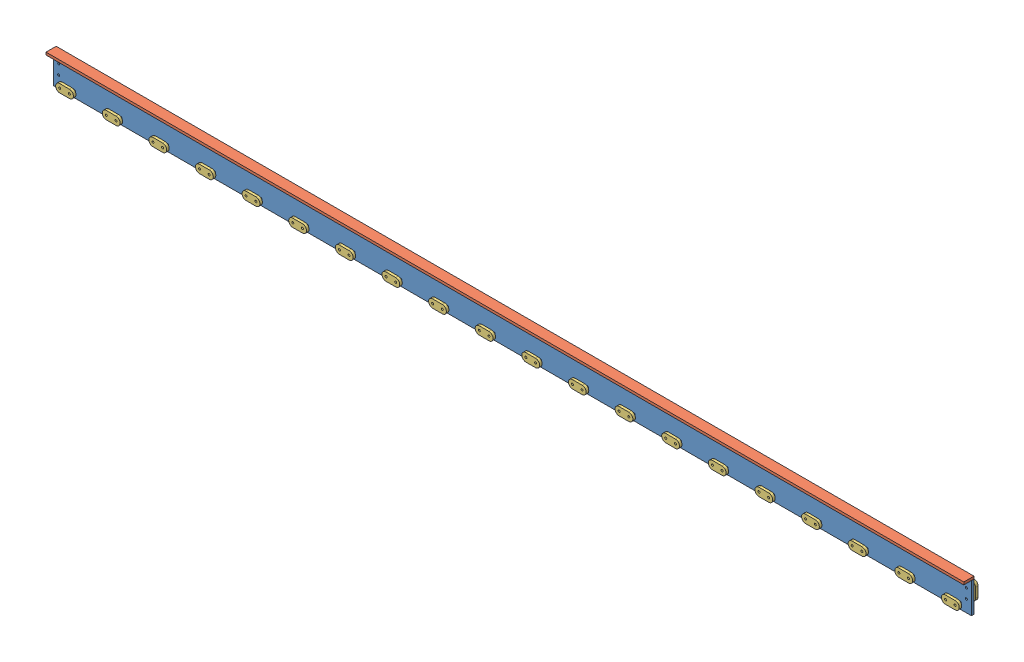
SolidWorks assembly fs-ua-angled-mount-assembly.SLDASM, configuration Default (file format 9000). Lengths in mm.
Overall size (2292.35 82.55 38).
24 component instances, 3 part files, 7 mates.
Components (placement in the parent):
- fs-ua-angled-mount-vertical-component-1: fs-ua-angled-mount-vertical-component.SLDPRT [Default] at origin size (2292.35 76.2 6.35)
- fs-ua-angled-mount-horizontal-component-1: fs-ua-angled-mount-horizontal-component.SLDPRT [Default] at (1146.175 76.2 12.7) size (2292.35 6.35 25.4)
- fs-clamp-1: fs-clamp.SLDPRT [Default] at (27.94 15.24 12.8007) size (44.45 20.32 6.35)
- fs-clamp-2: fs-clamp.SLDPRT [Default] at (144.3789 15.24 12.8007) size (44.45 20.32 6.35)
- fs-clamp-3: fs-clamp.SLDPRT [Default] at (260.8179 15.24 12.8007) size (44.45 20.32 6.35)
- fs-clamp-4: fs-clamp.SLDPRT [Default] at (377.2568 15.24 12.8007) size (44.45 20.32 6.35)
- fs-clamp-5: fs-clamp.SLDPRT [Default] at (493.6957 15.24 12.8007) size (44.45 20.32 6.35)
- fs-clamp-6: fs-clamp.SLDPRT [Default] at (610.1347 15.24 12.8007) size (44.45 20.32 6.35)
- fs-clamp-7: fs-clamp.SLDPRT [Default] at (726.5736 15.24 12.8007) size (44.45 20.32 6.35)
- fs-clamp-8: fs-clamp.SLDPRT [Default] at (843.0125 15.24 12.8007) size (44.45 20.32 6.35)
- fs-clamp-9: fs-clamp.SLDPRT [Default] at (959.4515 15.24 12.8007) size (44.45 20.32 6.35)
- fs-clamp-10: fs-clamp.SLDPRT [Default] at (1075.8904 15.24 12.8007) size (44.45 20.32 6.35)
- fs-clamp-11: fs-clamp.SLDPRT [Default] at (1192.3293 15.24 12.8007) size (44.45 20.32 6.35)
- fs-clamp-12: fs-clamp.SLDPRT [Default] at (1308.7683 15.24 12.8007) size (44.45 20.32 6.35)
- fs-clamp-13: fs-clamp.SLDPRT [Default] at (1425.2072 15.24 12.8007) size (44.45 20.32 6.35)
- fs-clamp-14: fs-clamp.SLDPRT [Default] at (1541.6461 15.24 12.8007) size (44.45 20.32 6.35)
- fs-clamp-15: fs-clamp.SLDPRT [Default] at (1658.0851 15.24 12.8007) size (44.45 20.32 6.35)
- fs-clamp-16: fs-clamp.SLDPRT [Default] at (1774.524 15.24 12.8007) size (44.45 20.32 6.35)
- fs-clamp-17: fs-clamp.SLDPRT [Default] at (1890.9629 15.24 12.8007) size (44.45 20.32 6.35)
- fs-clamp-18: fs-clamp.SLDPRT [Default] at (2007.4019 15.24 12.8007) size (44.45 20.32 6.35)
- fs-clamp-19: fs-clamp.SLDPRT [Default] at (12.7 53.975 -12.5735) x (0 -1 0) z (0 0 1) size (44.45 20.32 6.35)
- fs-clamp-20: fs-clamp.SLDPRT [Default] at (2279.65 29.845 -12.5985) x (0 1 0) z (0 0 1) size (44.45 20.32 6.35)
- fs-clamp-21: fs-clamp.SLDPRT [Default] at (2123.8408 15.24 12.8007) size (44.45 20.32 6.35)
- fs-clamp-22: fs-clamp.SLDPRT [Default] at (2240.2797 15.24 12.8007) size (44.45 20.32 6.35)
Mates (geometry in assembly coordinates):
- Coincident2: coincident aligned: line of fs-ua-angled-mount-vertical-component-1 through (2292.35 2292.35 76.2) axis (0 -1 0); line of fs-ua-angled-mount-horizontal-component-1 through (2292.35 2292.35 76.2) axis (0 -1 0)
- Coincident3: coincident anti-aligned: line of fs-ua-angled-mount-vertical-component-1 through (0 76.2 6.35) axis (0 0 -1); line of fs-ua-angled-mount-horizontal-component-1 through (0 76.2 0) axis (0 0 1)
- Concentric1: concentric anti-aligned: cylinder of fs-ua-angled-mount-vertical-component-1 through (27.94 15.24 -7.1842) axis (0 0 1) radius 2.54; cylinder of fs-clamp-1 through (27.94 15.24 19.1507) axis (0 0 -1) radius 2.54
- Concentric3: concentric anti-aligned: cylinder of fs-ua-angled-mount-vertical-component-1 through (12.7 53.975 -7.1842) axis (0 0 1) radius 2.54; cylinder of fs-clamp-19 through (12.7 53.975 -6.2235) axis (0 0 -1) radius 2.54
- Concentric4: concentric anti-aligned: cylinder of fs-ua-angled-mount-vertical-component-1 through (12.7 29.845 -7.1842) axis (0 0 1) radius 2.54; cylinder of fs-clamp-19 through (12.7 29.845 -6.2235) axis (0 0 -1) radius 2.54
- Concentric5: concentric anti-aligned: cylinder of fs-ua-angled-mount-vertical-component-1 through (2279.65 53.975 -7.1842) axis (0 0 1) radius 2.54; cylinder of fs-clamp-20 through (2279.65 53.975 -6.2485) axis (0 0 -1) radius 10.16
- Concentric6: concentric anti-aligned: cylinder of fs-ua-angled-mount-vertical-component-1 through (2279.65 29.845 -7.1842) axis (0 0 1) radius 2.54; cylinder of fs-clamp-20 through (2279.65 29.845 -6.2485) axis (0 0 -1) radius 2.54
